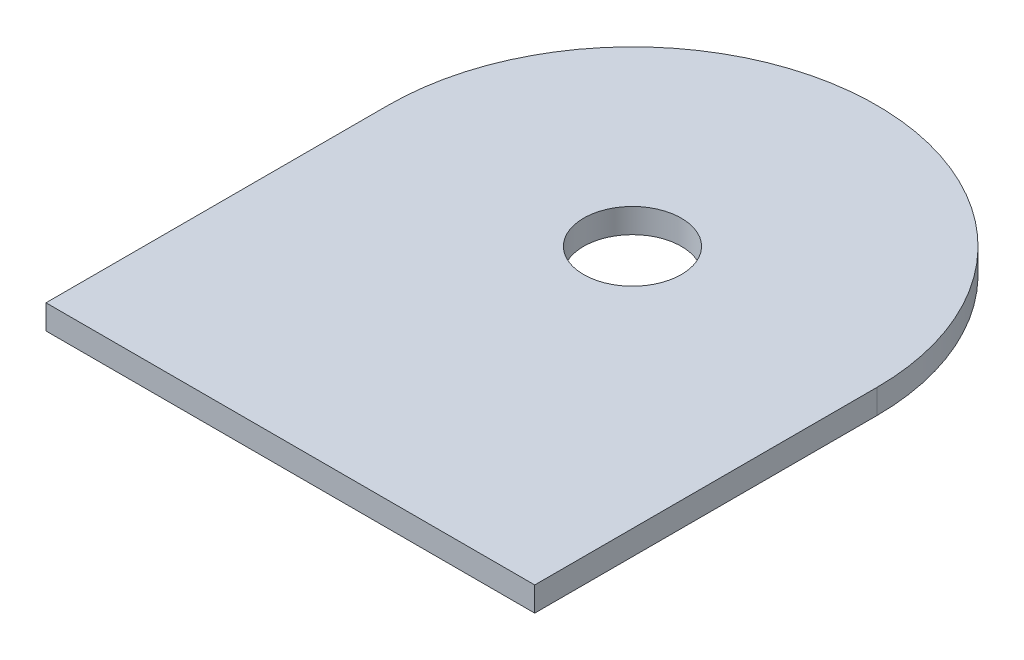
from build123d import *

# Parameters (mm, degrees)
SKETCH2_R           = 4
BOSS_EXTRUDE1_DEPTH = 2


with BuildPart() as part:
    # Sketch2 → Boss-Extrude1 (new body)
    with BuildSketch(Plane(origin=(0, 0, 0), x_dir=(1, 0, 0), z_dir=(0, 1, 0))):
        with BuildLine():
            Line((20, 0), (20, -28))
            Line((20, -28), (-20, -28))
            Line((-20, -28), (-20, 0))
            ThreePointArc((-20, 0), (0, 20), (20, 0))
        make_face()
        with Locations(Location((0, 0, 0), (0, 0, 270))):
            Circle(SKETCH2_R, mode=Mode.SUBTRACT)
    extrude(amount=BOSS_EXTRUDE1_DEPTH)


solid = part.part
